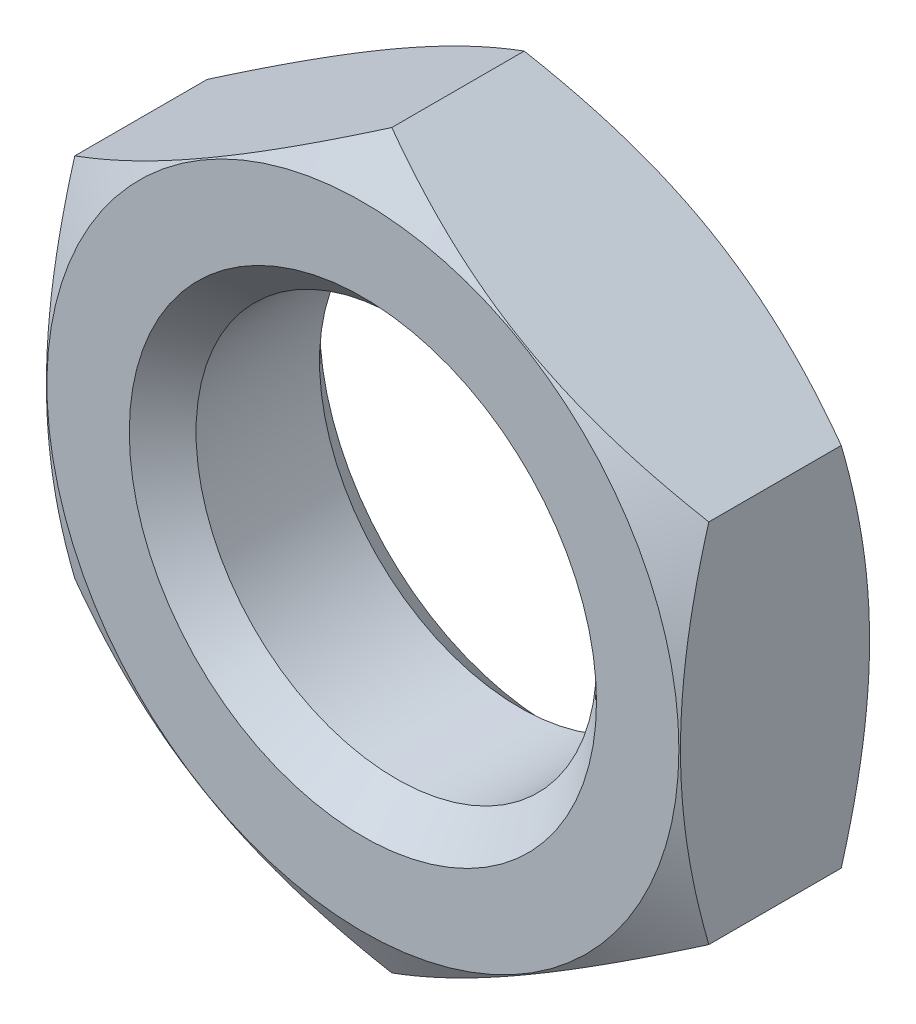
ISO-10303-21;
HEADER;
FILE_DESCRIPTION(('STEP AP214'),'2;1');
FILE_NAME('part.step','',(''),(''),'','','');
FILE_SCHEMA(('AUTOMOTIVE_DESIGN { 1 0 10303 214 1 1 1 1 }'));
ENDSEC;
DATA;
#1=APPLICATION_CONTEXT('core data for automotive mechanical design processes');
#2=APPLICATION_PROTOCOL_DEFINITION('international standard','automotive_design',2000,#1);
#3=PRODUCT_CONTEXT('',#1,'mechanical');
#4=PRODUCT('Part','Part','',(#3));
#5=PRODUCT_RELATED_PRODUCT_CATEGORY('part','',(#4));
#6=PRODUCT_DEFINITION_FORMATION('','',#4);
#7=PRODUCT_DEFINITION_CONTEXT('part definition',#1,'design');
#8=PRODUCT_DEFINITION('design','',#6,#7);
#9=PRODUCT_DEFINITION_SHAPE('','',#8);
#10=(LENGTH_UNIT() NAMED_UNIT(*) SI_UNIT(.MILLI.,.METRE.));
#11=(NAMED_UNIT(*) PLANE_ANGLE_UNIT() SI_UNIT($,.RADIAN.));
#12=(NAMED_UNIT(*) SI_UNIT($,.STERADIAN.) SOLID_ANGLE_UNIT());
#13=UNCERTAINTY_MEASURE_WITH_UNIT(LENGTH_MEASURE(1.E-05),#10,'distance_accuracy_value','');
#14=(GEOMETRIC_REPRESENTATION_CONTEXT(3) GLOBAL_UNCERTAINTY_ASSIGNED_CONTEXT((#13)) GLOBAL_UNIT_ASSIGNED_CONTEXT((#10,
#11,#12)) REPRESENTATION_CONTEXT('',''));
#15=CARTESIAN_POINT('',(0.,0.,0.));
#16=DIRECTION('',(0.,0.,1.));
#17=DIRECTION('',(1.,0.,0.));
#18=AXIS2_PLACEMENT_3D('',#15,#16,#17);
#19=CARTESIAN_POINT('',(9.5,5.48482755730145,2.85));
#20=DIRECTION('',(-0.5,-0.866025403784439,0.));
#21=DIRECTION('',(0.866025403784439,-0.5,0.));
#22=AXIS2_PLACEMENT_3D('',#19,#20,#21);
#23=PLANE('',#22);
#24=CARTESIAN_POINT('',(-0.000199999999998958,10.9697705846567,-1.98390792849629));
#25=CARTESIAN_POINT('',(0.208630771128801,10.8492020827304,-2.05350693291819));
#26=CARTESIAN_POINT('',(0.41824017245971,10.7281840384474,-2.11994706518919));
#27=CARTESIAN_POINT('',(0.839139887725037,10.4851774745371,-2.24563309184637));
#28=CARTESIAN_POINT('',(1.05043073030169,10.3631886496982,-2.30487662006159));
#29=CARTESIAN_POINT('',(1.68770779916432,9.99525656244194,-2.47066579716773));
#30=CARTESIAN_POINT('',(2.11620976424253,9.74786083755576,-2.56496593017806));
#31=CARTESIAN_POINT('',(2.75744333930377,9.37764446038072,-2.6755416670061));
#32=CARTESIAN_POINT('',(2.96825921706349,9.2559298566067,-2.70704054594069));
#33=CARTESIAN_POINT('',(3.39086703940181,9.01193711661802,-2.75986217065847));
#34=CARTESIAN_POINT('',(3.60265900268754,8.88965896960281,-2.78118472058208));
#35=CARTESIAN_POINT('',(4.02659621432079,8.64489870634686,-2.81310735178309));
#36=CARTESIAN_POINT('',(4.23874074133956,8.52241700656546,-2.82372017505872));
#37=CARTESIAN_POINT('',(4.66322575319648,8.27734047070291,-2.83399784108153));
#38=CARTESIAN_POINT('',(4.87556623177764,8.15474563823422,-2.83366302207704));
#39=CARTESIAN_POINT('',(5.27254199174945,7.92555157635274,-2.82280700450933));
#40=CARTESIAN_POINT('',(5.45720529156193,7.81893617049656,-2.81361010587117));
#41=CARTESIAN_POINT('',(5.82610000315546,7.60595470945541,-2.78711497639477));
#42=CARTESIAN_POINT('',(6.01033138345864,7.49958867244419,-2.76981617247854));
#43=CARTESIAN_POINT('',(6.562311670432,7.18090270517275,-2.70617589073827));
#44=CARTESIAN_POINT('',(6.92908353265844,6.96914687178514,-2.64809847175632));
#45=CARTESIAN_POINT('',(7.66651782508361,6.5433889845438,-2.50290435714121));
#46=CARTESIAN_POINT('',(8.03708614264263,6.32944126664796,-2.41517220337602));
#47=CARTESIAN_POINT('',(8.77269671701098,5.90473630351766,-2.21605663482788));
#48=CARTESIAN_POINT('',(9.13774839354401,5.69397361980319,-2.1047199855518));
#49=CARTESIAN_POINT('',(9.5002,5.48471208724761,-1.98390792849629));
#50=B_SPLINE_CURVE_WITH_KNOTS('',3,(#24,#25,#26,#27,#28,#29,#30,#31,#32,#33,#34,#35,#36,#37,#38,
#39,#40,#41,#42,#43,#44,#45,#46,#47,#48,#49),.UNSPECIFIED.,.F.,.F.,(4,2,2,2,2,2,2,2,2,2,2,2,4),
(0.,0.752880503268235,1.50600787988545,3.0154687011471,3.75167336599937,4.48789219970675,
5.22323407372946,5.95855322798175,6.5986808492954,7.23885375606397,8.52010929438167,
9.82978009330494,11.1368800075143),.UNSPECIFIED.);
#51=CARTESIAN_POINT('',(0.,10.9696551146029,-1.98397459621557));
#52=VERTEX_POINT('',#51);
#53=CARTESIAN_POINT('',(9.5,5.48482755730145,-1.98397459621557));
#54=VERTEX_POINT('',#53);
#55=EDGE_CURVE('E47',#52,#54,#50,.T.);
#56=ORIENTED_EDGE('',*,*,#55,.F.);
#57=DIRECTION('',(0.,0.,-1.));
#58=VECTOR('',#57,1.);
#59=CARTESIAN_POINT('',(0.,10.9696551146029,2.85));
#60=LINE('',#59,#58);
#61=CARTESIAN_POINT('',(0.,10.9696551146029,1.98397459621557));
#62=VERTEX_POINT('',#61);
#63=EDGE_CURVE('E96',#62,#52,#60,.T.);
#64=ORIENTED_EDGE('',*,*,#63,.F.);
#65=CARTESIAN_POINT('',(9.5002,5.48471208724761,1.98390792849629));
#66=CARTESIAN_POINT('',(9.2913692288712,5.6052805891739,2.05350693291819));
#67=CARTESIAN_POINT('',(9.08175982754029,5.72629863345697,2.11994706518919));
#68=CARTESIAN_POINT('',(8.66086011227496,5.96930519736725,2.24563309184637));
#69=CARTESIAN_POINT('',(8.44956926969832,6.09129402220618,2.30487662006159));
#70=CARTESIAN_POINT('',(7.81229220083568,6.4592261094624,2.47066579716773));
#71=CARTESIAN_POINT('',(7.38379023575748,6.70662183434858,2.56496593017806));
#72=CARTESIAN_POINT('',(6.74255666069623,7.07683821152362,2.6755416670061));
#73=CARTESIAN_POINT('',(6.53174078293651,7.19855281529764,2.70704054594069));
#74=CARTESIAN_POINT('',(6.10913296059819,7.44254555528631,2.75986217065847));
#75=CARTESIAN_POINT('',(5.89734099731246,7.56482370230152,2.78118472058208));
#76=CARTESIAN_POINT('',(5.47340378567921,7.80958396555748,2.81310735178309));
#77=CARTESIAN_POINT('',(5.26125925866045,7.93206566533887,2.82372017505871));
#78=CARTESIAN_POINT('',(4.83677424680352,8.17714220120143,2.83399784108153));
#79=CARTESIAN_POINT('',(4.62443376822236,8.29973703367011,2.83366302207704));
#80=CARTESIAN_POINT('',(4.22745800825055,8.5289310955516,2.82280700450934));
#81=CARTESIAN_POINT('',(4.04279470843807,8.63554650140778,2.81361010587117));
#82=CARTESIAN_POINT('',(3.67389999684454,8.84852796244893,2.78711497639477));
#83=CARTESIAN_POINT('',(3.48966861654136,8.95489399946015,2.76981617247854));
#84=CARTESIAN_POINT('',(2.937688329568,9.27357996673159,2.70617589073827));
#85=CARTESIAN_POINT('',(2.57091646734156,9.4853358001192,2.64809847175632));
#86=CARTESIAN_POINT('',(1.83348217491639,9.91109368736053,2.50290435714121));
#87=CARTESIAN_POINT('',(1.46291385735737,10.1250414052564,2.41517220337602));
#88=CARTESIAN_POINT('',(0.727303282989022,10.5497463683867,2.21605663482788));
#89=CARTESIAN_POINT('',(0.362251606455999,10.7605090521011,2.1047199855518));
#90=CARTESIAN_POINT('',(-0.000199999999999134,10.9697705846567,1.98390792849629));
#91=B_SPLINE_CURVE_WITH_KNOTS('',3,(#65,#66,#67,#68,#69,#70,#71,#72,#73,#74,#75,#76,#77,#78,#79,
#80,#81,#82,#83,#84,#85,#86,#87,#88,#89,#90),.UNSPECIFIED.,.F.,.F.,(4,2,2,2,2,2,2,2,2,2,2,2,4),
(0.,0.752880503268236,1.50600787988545,3.0154687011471,3.75167336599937,4.48789219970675,
5.22323407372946,5.95855322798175,6.5986808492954,7.23885375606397,8.52010929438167,
9.82978009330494,11.1368800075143),.UNSPECIFIED.);
#92=CARTESIAN_POINT('',(9.5,5.48482755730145,1.98397459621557));
#93=VERTEX_POINT('',#92);
#94=EDGE_CURVE('E198',#93,#62,#91,.T.);
#95=ORIENTED_EDGE('',*,*,#94,.F.);
#96=DIRECTION('',(0.,0.,-1.));
#97=VECTOR('',#96,1.);
#98=CARTESIAN_POINT('',(9.5,5.48482755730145,2.85));
#99=LINE('',#98,#97);
#100=EDGE_CURVE('E98',#93,#54,#99,.T.);
#101=ORIENTED_EDGE('',*,*,#100,.T.);
#102=EDGE_LOOP('',(#56,#64,#95,#101));
#103=FACE_BOUND('',#102,.T.);
#104=ADVANCED_FACE('F32',(#103),#23,.F.);
#105=CARTESIAN_POINT('',(0.,10.9696551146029,2.85));
#106=DIRECTION('',(0.5,-0.866025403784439,0.));
#107=DIRECTION('',(0.866025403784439,0.5,0.));
#108=AXIS2_PLACEMENT_3D('',#105,#106,#107);
#109=PLANE('',#108);
#110=CARTESIAN_POINT('',(-9.5002,5.48471208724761,-1.98390792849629));
#111=CARTESIAN_POINT('',(-9.2913692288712,5.6052805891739,-2.05350693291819));
#112=CARTESIAN_POINT('',(-9.08175982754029,5.72629863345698,-2.11994706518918));
#113=CARTESIAN_POINT('',(-8.66086011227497,5.96930519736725,-2.24563309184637));
#114=CARTESIAN_POINT('',(-8.44956926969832,6.09129402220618,-2.30487662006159));
#115=CARTESIAN_POINT('',(-7.81229220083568,6.4592261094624,-2.47066579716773));
#116=CARTESIAN_POINT('',(-7.38379023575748,6.70662183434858,-2.56496593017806));
#117=CARTESIAN_POINT('',(-6.74255666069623,7.07683821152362,-2.6755416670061));
#118=CARTESIAN_POINT('',(-6.53174078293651,7.19855281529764,-2.70704054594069));
#119=CARTESIAN_POINT('',(-6.10913296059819,7.44254555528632,-2.75986217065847));
#120=CARTESIAN_POINT('',(-5.89734099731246,7.56482370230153,-2.78118472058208));
#121=CARTESIAN_POINT('',(-5.47340378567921,7.80958396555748,-2.81310735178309));
#122=CARTESIAN_POINT('',(-5.26125925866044,7.93206566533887,-2.82372017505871));
#123=CARTESIAN_POINT('',(-4.83677424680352,8.17714220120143,-2.83399784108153));
#124=CARTESIAN_POINT('',(-4.62443376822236,8.29973703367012,-2.83366302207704));
#125=CARTESIAN_POINT('',(-4.22745800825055,8.5289310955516,-2.82280700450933));
#126=CARTESIAN_POINT('',(-4.04279470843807,8.63554650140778,-2.81361010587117));
#127=CARTESIAN_POINT('',(-3.67389999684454,8.84852796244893,-2.78711497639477));
#128=CARTESIAN_POINT('',(-3.48966861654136,8.95489399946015,-2.76981617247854));
#129=CARTESIAN_POINT('',(-2.937688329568,9.27357996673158,-2.70617589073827));
#130=CARTESIAN_POINT('',(-2.57091646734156,9.4853358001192,-2.64809847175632));
#131=CARTESIAN_POINT('',(-1.83348217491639,9.91109368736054,-2.50290435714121));
#132=CARTESIAN_POINT('',(-1.46291385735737,10.1250414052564,-2.41517220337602));
#133=CARTESIAN_POINT('',(-0.72730328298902,10.5497463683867,-2.21605663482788));
#134=CARTESIAN_POINT('',(-0.362251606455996,10.7605090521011,-2.1047199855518));
#135=CARTESIAN_POINT('',(0.000200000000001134,10.9697705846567,-1.98390792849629));
#136=B_SPLINE_CURVE_WITH_KNOTS('',3,(#110,#111,#112,#113,#114,#115,#116,#117,#118,#119,#120,
#121,#122,#123,#124,#125,#126,#127,#128,#129,#130,#131,#132,#133,#134,#135),.UNSPECIFIED.,.F.,
.F.,(4,2,2,2,2,2,2,2,2,2,2,2,4),(0.,0.752880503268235,1.50600787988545,3.0154687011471,
3.75167336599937,4.48789219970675,5.22323407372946,5.95855322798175,6.59868084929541,
7.23885375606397,8.52010929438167,9.82978009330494,11.1368800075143),.UNSPECIFIED.);
#137=CARTESIAN_POINT('',(-9.5,5.48482755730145,-1.98397459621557));
#138=VERTEX_POINT('',#137);
#139=EDGE_CURVE('E83',#138,#52,#136,.T.);
#140=ORIENTED_EDGE('',*,*,#139,.F.);
#141=DIRECTION('',(0.,0.,-1.));
#142=VECTOR('',#141,1.);
#143=CARTESIAN_POINT('',(-9.5,5.48482755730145,2.85));
#144=LINE('',#143,#142);
#145=CARTESIAN_POINT('',(-9.5,5.48482755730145,1.98397459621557));
#146=VERTEX_POINT('',#145);
#147=EDGE_CURVE('E105',#146,#138,#144,.T.);
#148=ORIENTED_EDGE('',*,*,#147,.F.);
#149=CARTESIAN_POINT('',(0.000200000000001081,10.9697705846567,1.98390792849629));
#150=CARTESIAN_POINT('',(-0.208630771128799,10.8492020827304,2.05350693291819));
#151=CARTESIAN_POINT('',(-0.418240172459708,10.7281840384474,2.11994706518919));
#152=CARTESIAN_POINT('',(-0.839139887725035,10.4851774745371,2.24563309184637));
#153=CARTESIAN_POINT('',(-1.05043073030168,10.3631886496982,2.30487662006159));
#154=CARTESIAN_POINT('',(-1.68770779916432,9.99525656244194,2.47066579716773));
#155=CARTESIAN_POINT('',(-2.11620976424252,9.74786083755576,2.56496593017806));
#156=CARTESIAN_POINT('',(-2.75744333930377,9.37764446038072,2.6755416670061));
#157=CARTESIAN_POINT('',(-2.96825921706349,9.2559298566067,2.70704054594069));
#158=CARTESIAN_POINT('',(-3.39086703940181,9.01193711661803,2.75986217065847));
#159=CARTESIAN_POINT('',(-3.60265900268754,8.88965896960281,2.78118472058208));
#160=CARTESIAN_POINT('',(-4.02659621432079,8.64489870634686,2.81310735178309));
#161=CARTESIAN_POINT('',(-4.23874074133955,8.52241700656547,2.82372017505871));
#162=CARTESIAN_POINT('',(-4.66322575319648,8.27734047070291,2.83399784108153));
#163=CARTESIAN_POINT('',(-4.87556623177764,8.15474563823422,2.83366302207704));
#164=CARTESIAN_POINT('',(-5.27254199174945,7.92555157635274,2.82280700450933));
#165=CARTESIAN_POINT('',(-5.45720529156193,7.81893617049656,2.81361010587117));
#166=CARTESIAN_POINT('',(-5.82610000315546,7.60595470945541,2.78711497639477));
#167=CARTESIAN_POINT('',(-6.01033138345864,7.49958867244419,2.76981617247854));
#168=CARTESIAN_POINT('',(-6.562311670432,7.18090270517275,2.70617589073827));
#169=CARTESIAN_POINT('',(-6.92908353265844,6.96914687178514,2.64809847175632));
#170=CARTESIAN_POINT('',(-7.66651782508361,6.5433889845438,2.50290435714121));
#171=CARTESIAN_POINT('',(-8.03708614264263,6.32944126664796,2.41517220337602));
#172=CARTESIAN_POINT('',(-8.77269671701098,5.90473630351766,2.21605663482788));
#173=CARTESIAN_POINT('',(-9.137748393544,5.69397361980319,2.1047199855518));
#174=CARTESIAN_POINT('',(-9.5002,5.48471208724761,1.98390792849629));
#175=B_SPLINE_CURVE_WITH_KNOTS('',3,(#149,#150,#151,#152,#153,#154,#155,#156,#157,#158,#159,
#160,#161,#162,#163,#164,#165,#166,#167,#168,#169,#170,#171,#172,#173,#174),.UNSPECIFIED.,.F.,
.F.,(4,2,2,2,2,2,2,2,2,2,2,2,4),(0.,0.752880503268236,1.50600787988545,3.0154687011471,
3.75167336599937,4.48789219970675,5.22323407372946,5.95855322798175,6.59868084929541,
7.23885375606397,8.52010929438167,9.82978009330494,11.1368800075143),.UNSPECIFIED.);
#176=EDGE_CURVE('E103',#62,#146,#175,.T.);
#177=ORIENTED_EDGE('',*,*,#176,.F.);
#178=ORIENTED_EDGE('',*,*,#63,.T.);
#179=EDGE_LOOP('',(#140,#148,#177,#178));
#180=FACE_BOUND('',#179,.T.);
#181=ADVANCED_FACE('F102',(#180),#109,.F.);
#182=CARTESIAN_POINT('',(-9.5,5.48482755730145,2.85));
#183=DIRECTION('',(1.,0.,0.));
#184=DIRECTION('',(0.,0.,-1.));
#185=AXIS2_PLACEMENT_3D('',#182,#183,#184);
#186=PLANE('',#185);
#187=CARTESIAN_POINT('',(-9.5,-14.5441411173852,1.71234877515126));
#188=CARTESIAN_POINT('',(-9.5,-14.3356064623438,1.6115512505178));
#189=CARTESIAN_POINT('',(-9.5,-14.1268196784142,1.51127559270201));
#190=CARTESIAN_POINT('',(-9.5,-13.7086885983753,1.31188780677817));
#191=CARTESIAN_POINT('',(-9.5,-13.499344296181,1.2127756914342));
#192=CARTESIAN_POINT('',(-9.5,-12.8703338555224,0.917335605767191));
#193=CARTESIAN_POINT('',(-9.5,-12.4497580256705,0.722936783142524));
#194=CARTESIAN_POINT('',(-9.5,-11.6032912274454,0.339426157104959));
#195=CARTESIAN_POINT('',(-9.5,-11.1773836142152,0.150350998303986));
#196=CARTESIAN_POINT('',(-9.5,-10.3220676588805,-0.21967779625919));
#197=CARTESIAN_POINT('',(-9.5,-9.89265950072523,-0.400631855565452));
#198=CARTESIAN_POINT('',(-9.5,-9.02433880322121,-0.754397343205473));
#199=CARTESIAN_POINT('',(-9.5,-8.58537427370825,-0.927081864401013));
#200=CARTESIAN_POINT('',(-9.5,-7.7022679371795,-1.25892058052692));
#201=CARTESIAN_POINT('',(-9.5,-7.25812556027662,-1.41807326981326));
#202=CARTESIAN_POINT('',(-9.5,-6.36486440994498,-1.71856922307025));
#203=CARTESIAN_POINT('',(-9.5,-5.91575852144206,-1.85995037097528));
#204=CARTESIAN_POINT('',(-9.5,-5.01117837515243,-2.12031248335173));
#205=CARTESIAN_POINT('',(-9.5,-4.55570618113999,-2.23930053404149));
#206=CARTESIAN_POINT('',(-9.5,-3.63800520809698,-2.44908988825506));
#207=CARTESIAN_POINT('',(-9.5,-3.17577463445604,-2.53988355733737));
#208=CARTESIAN_POINT('',(-9.5,-2.47836338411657,-2.65038075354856));
#209=CARTESIAN_POINT('',(-9.5,-2.24518677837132,-2.68293333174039));
#210=CARTESIAN_POINT('',(-9.5,-1.77774118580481,-2.73883350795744));
#211=CARTESIAN_POINT('',(-9.5,-1.54347230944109,-2.76218201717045));
#212=CARTESIAN_POINT('',(-9.5,-1.07564354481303,-2.79904583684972));
#213=CARTESIAN_POINT('',(-9.5,-0.842088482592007,-2.81262214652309));
#214=CARTESIAN_POINT('',(-9.5,-0.374613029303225,-2.82986982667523));
#215=CARTESIAN_POINT('',(-9.5,-0.140692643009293,-2.83354132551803));
#216=CARTESIAN_POINT('',(-9.5,0.327026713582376,-2.83089191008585));
#217=CARTESIAN_POINT('',(-9.5,0.560825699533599,-2.8245737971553));
#218=CARTESIAN_POINT('',(-9.5,1.02795364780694,-2.80210220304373));
#219=CARTESIAN_POINT('',(-9.5,1.26128258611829,-2.78594823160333));
#220=CARTESIAN_POINT('',(-9.5,1.82687816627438,-2.735206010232));
#221=CARTESIAN_POINT('',(-9.5,2.15870953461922,-2.69568528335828));
#222=CARTESIAN_POINT('',(-9.5,2.81982783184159,-2.59894476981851));
#223=CARTESIAN_POINT('',(-9.5,3.14911404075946,-2.54172015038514));
#224=CARTESIAN_POINT('',(-9.5,3.80487091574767,-2.41160145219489));
#225=CARTESIAN_POINT('',(-9.5,4.1313386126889,-2.33869255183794));
#226=CARTESIAN_POINT('',(-9.5,4.78091434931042,-2.17942968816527));
#227=CARTESIAN_POINT('',(-9.5,5.10402270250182,-2.0930769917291));
#228=CARTESIAN_POINT('',(-9.5,5.75483447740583,-1.90673599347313));
#229=CARTESIAN_POINT('',(-9.5,6.08245652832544,-1.80646544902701));
#230=CARTESIAN_POINT('',(-9.5,6.73423760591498,-1.59602223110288));
#231=CARTESIAN_POINT('',(-9.5,7.05839885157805,-1.48585638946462));
#232=CARTESIAN_POINT('',(-9.5,7.70195753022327,-1.25789772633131));
#233=CARTESIAN_POINT('',(-9.5,8.02137150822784,-1.14015133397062));
#234=CARTESIAN_POINT('',(-9.5,8.65772169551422,-0.897750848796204));
#235=CARTESIAN_POINT('',(-9.5,8.97465684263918,-0.773093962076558));
#236=CARTESIAN_POINT('',(-9.5,9.29044082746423,-0.645665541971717));
#237=B_SPLINE_CURVE_WITH_KNOTS('',3,(#187,#188,#189,#190,#191,#192,#193,#194,#195,#196,#197,
#198,#199,#200,#201,#202,#203,#204,#205,#206,#207,#208,#209,#210,#211,#212,#213,#214,#215,#216,
#217,#218,#219,#220,#221,#222,#223,#224,#225,#226,#227,#228,#229,#230,#231,#232,#233,#234,#235,
#236),.UNSPECIFIED.,.F.,.F.,(4,2,2,2,2,2,2,2,2,2,2,2,2,2,2,2,2,2,2,2,2,2,2,2,4),(0.,
0.694852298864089,1.38971221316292,2.77965820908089,4.17756254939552,5.57539389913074,
6.99034929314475,8.40546191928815,9.81750483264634,11.2291001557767,12.6410773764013,
13.3472378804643,14.0533284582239,14.754972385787,15.4566072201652,16.1580453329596,
16.859518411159,17.8614895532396,18.8637344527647,19.866930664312,20.8700323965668,
21.897710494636,22.9246844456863,23.9458768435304,24.9674851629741),.UNSPECIFIED.);
#238=CARTESIAN_POINT('',(-9.5,-5.48482755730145,-1.98397459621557));
#239=VERTEX_POINT('',#238);
#240=EDGE_CURVE('E86',#239,#138,#237,.T.);
#241=ORIENTED_EDGE('',*,*,#240,.F.);
#242=DIRECTION('',(0.,0.,-1.));
#243=VECTOR('',#242,1.);
#244=CARTESIAN_POINT('',(-9.5,-5.48482755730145,2.85));
#245=LINE('',#244,#243);
#246=CARTESIAN_POINT('',(-9.5,-5.48482755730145,1.98397459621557));
#247=VERTEX_POINT('',#246);
#248=EDGE_CURVE('E110',#247,#239,#245,.T.);
#249=ORIENTED_EDGE('',*,*,#248,.F.);
#250=CARTESIAN_POINT('',(-9.5,-14.5441411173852,-1.71234877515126));
#251=CARTESIAN_POINT('',(-9.5,-14.3356064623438,-1.6115512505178));
#252=CARTESIAN_POINT('',(-9.5,-14.1268196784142,-1.51127559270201));
#253=CARTESIAN_POINT('',(-9.5,-13.7086885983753,-1.31188780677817));
#254=CARTESIAN_POINT('',(-9.5,-13.499344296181,-1.2127756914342));
#255=CARTESIAN_POINT('',(-9.5,-12.8703338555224,-0.917335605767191));
#256=CARTESIAN_POINT('',(-9.5,-12.4497580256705,-0.722936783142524));
#257=CARTESIAN_POINT('',(-9.5,-11.6032912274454,-0.339426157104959));
#258=CARTESIAN_POINT('',(-9.5,-11.1773836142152,-0.150350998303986));
#259=CARTESIAN_POINT('',(-9.5,-10.3220676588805,0.21967779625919));
#260=CARTESIAN_POINT('',(-9.5,-9.89265950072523,0.400631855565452));
#261=CARTESIAN_POINT('',(-9.5,-9.02433880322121,0.754397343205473));
#262=CARTESIAN_POINT('',(-9.5,-8.58537427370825,0.927081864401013));
#263=CARTESIAN_POINT('',(-9.5,-7.7022679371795,1.25892058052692));
#264=CARTESIAN_POINT('',(-9.5,-7.25812556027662,1.41807326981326));
#265=CARTESIAN_POINT('',(-9.5,-6.36486440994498,1.71856922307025));
#266=CARTESIAN_POINT('',(-9.5,-5.91575852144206,1.85995037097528));
#267=CARTESIAN_POINT('',(-9.5,-5.01117837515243,2.12031248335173));
#268=CARTESIAN_POINT('',(-9.5,-4.55570618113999,2.23930053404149));
#269=CARTESIAN_POINT('',(-9.5,-3.63800520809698,2.44908988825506));
#270=CARTESIAN_POINT('',(-9.5,-3.17577463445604,2.53988355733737));
#271=CARTESIAN_POINT('',(-9.5,-2.47836338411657,2.65038075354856));
#272=CARTESIAN_POINT('',(-9.5,-2.24518677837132,2.68293333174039));
#273=CARTESIAN_POINT('',(-9.5,-1.77774118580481,2.73883350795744));
#274=CARTESIAN_POINT('',(-9.5,-1.54347230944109,2.76218201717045));
#275=CARTESIAN_POINT('',(-9.5,-1.07564354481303,2.79904583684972));
#276=CARTESIAN_POINT('',(-9.5,-0.842088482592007,2.81262214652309));
#277=CARTESIAN_POINT('',(-9.5,-0.374613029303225,2.82986982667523));
#278=CARTESIAN_POINT('',(-9.5,-0.140692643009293,2.83354132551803));
#279=CARTESIAN_POINT('',(-9.5,0.327026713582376,2.83089191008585));
#280=CARTESIAN_POINT('',(-9.5,0.560825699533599,2.8245737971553));
#281=CARTESIAN_POINT('',(-9.5,1.02795364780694,2.80210220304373));
#282=CARTESIAN_POINT('',(-9.5,1.26128258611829,2.78594823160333));
#283=CARTESIAN_POINT('',(-9.5,1.82687816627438,2.735206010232));
#284=CARTESIAN_POINT('',(-9.5,2.15870953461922,2.69568528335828));
#285=CARTESIAN_POINT('',(-9.5,2.81982783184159,2.59894476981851));
#286=CARTESIAN_POINT('',(-9.5,3.14911404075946,2.54172015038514));
#287=CARTESIAN_POINT('',(-9.5,3.80487091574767,2.41160145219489));
#288=CARTESIAN_POINT('',(-9.5,4.1313386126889,2.33869255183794));
#289=CARTESIAN_POINT('',(-9.5,4.78091434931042,2.17942968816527));
#290=CARTESIAN_POINT('',(-9.5,5.10402270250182,2.0930769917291));
#291=CARTESIAN_POINT('',(-9.5,5.75483447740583,1.90673599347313));
#292=CARTESIAN_POINT('',(-9.5,6.08245652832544,1.80646544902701));
#293=CARTESIAN_POINT('',(-9.5,6.73423760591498,1.59602223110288));
#294=CARTESIAN_POINT('',(-9.5,7.05839885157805,1.48585638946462));
#295=CARTESIAN_POINT('',(-9.5,7.70195753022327,1.25789772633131));
#296=CARTESIAN_POINT('',(-9.5,8.02137150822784,1.14015133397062));
#297=CARTESIAN_POINT('',(-9.5,8.65772169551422,0.897750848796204));
#298=CARTESIAN_POINT('',(-9.5,8.97465684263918,0.773093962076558));
#299=CARTESIAN_POINT('',(-9.5,9.29044082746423,0.645665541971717));
#300=B_SPLINE_CURVE_WITH_KNOTS('',3,(#250,#251,#252,#253,#254,#255,#256,#257,#258,#259,#260,
#261,#262,#263,#264,#265,#266,#267,#268,#269,#270,#271,#272,#273,#274,#275,#276,#277,#278,#279,
#280,#281,#282,#283,#284,#285,#286,#287,#288,#289,#290,#291,#292,#293,#294,#295,#296,#297,#298,
#299),.UNSPECIFIED.,.F.,.F.,(4,2,2,2,2,2,2,2,2,2,2,2,2,2,2,2,2,2,2,2,2,2,2,2,4),(0.,
0.694852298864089,1.38971221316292,2.77965820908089,4.17756254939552,5.57539389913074,
6.99034929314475,8.40546191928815,9.81750483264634,11.2291001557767,12.6410773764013,
13.3472378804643,14.0533284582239,14.754972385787,15.4566072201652,16.1580453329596,
16.859518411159,17.8614895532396,18.8637344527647,19.866930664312,20.8700323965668,
21.897710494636,22.9246844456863,23.9458768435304,24.9674851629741),.UNSPECIFIED.);
#301=EDGE_CURVE('E188',#146,#247,#300,.F.);
#302=ORIENTED_EDGE('',*,*,#301,.F.);
#303=ORIENTED_EDGE('',*,*,#147,.T.);
#304=EDGE_LOOP('',(#241,#249,#302,#303));
#305=FACE_BOUND('',#304,.T.);
#306=ADVANCED_FACE('F206',(#305),#186,.F.);
#307=CARTESIAN_POINT('',(-9.5,-5.48482755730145,2.85));
#308=DIRECTION('',(0.5,0.866025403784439,0.));
#309=DIRECTION('',(-0.866025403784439,0.5,0.));
#310=AXIS2_PLACEMENT_3D('',#307,#308,#309);
#311=PLANE('',#310);
#312=CARTESIAN_POINT('',(0.000199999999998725,-10.9697705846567,-1.98390792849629));
#313=CARTESIAN_POINT('',(-0.208630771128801,-10.8492020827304,-2.05350693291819));
#314=CARTESIAN_POINT('',(-0.41824017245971,-10.7281840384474,-2.11994706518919));
#315=CARTESIAN_POINT('',(-0.839139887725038,-10.4851774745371,-2.24563309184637));
#316=CARTESIAN_POINT('',(-1.05043073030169,-10.3631886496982,-2.30487662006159));
#317=CARTESIAN_POINT('',(-1.68770779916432,-9.99525656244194,-2.47066579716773));
#318=CARTESIAN_POINT('',(-2.11620976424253,-9.74786083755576,-2.56496593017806));
#319=CARTESIAN_POINT('',(-2.75744333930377,-9.37764446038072,-2.6755416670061));
#320=CARTESIAN_POINT('',(-2.96825921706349,-9.2559298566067,-2.70704054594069));
#321=CARTESIAN_POINT('',(-3.39086703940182,-9.01193711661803,-2.75986217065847));
#322=CARTESIAN_POINT('',(-3.60265900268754,-8.88965896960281,-2.78118472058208));
#323=CARTESIAN_POINT('',(-4.02659621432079,-8.64489870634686,-2.81310735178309));
#324=CARTESIAN_POINT('',(-4.23874074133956,-8.52241700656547,-2.82372017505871));
#325=CARTESIAN_POINT('',(-4.66322575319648,-8.27734047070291,-2.83399784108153));
#326=CARTESIAN_POINT('',(-4.87556623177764,-8.15474563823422,-2.83366302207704));
#327=CARTESIAN_POINT('',(-5.27254199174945,-7.92555157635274,-2.82280700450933));
#328=CARTESIAN_POINT('',(-5.45720529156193,-7.81893617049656,-2.81361010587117));
#329=CARTESIAN_POINT('',(-5.82610000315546,-7.60595470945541,-2.78711497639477));
#330=CARTESIAN_POINT('',(-6.01033138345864,-7.49958867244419,-2.76981617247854));
#331=CARTESIAN_POINT('',(-6.562311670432,-7.18090270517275,-2.70617589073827));
#332=CARTESIAN_POINT('',(-6.92908353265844,-6.96914687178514,-2.64809847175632));
#333=CARTESIAN_POINT('',(-7.66651782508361,-6.5433889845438,-2.50290435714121));
#334=CARTESIAN_POINT('',(-8.03708614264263,-6.32944126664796,-2.41517220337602));
#335=CARTESIAN_POINT('',(-8.77269671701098,-5.90473630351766,-2.21605663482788));
#336=CARTESIAN_POINT('',(-9.13774839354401,-5.69397361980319,-2.1047199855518));
#337=CARTESIAN_POINT('',(-9.5002,-5.48471208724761,-1.98390792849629));
#338=B_SPLINE_CURVE_WITH_KNOTS('',3,(#312,#313,#314,#315,#316,#317,#318,#319,#320,#321,#322,
#323,#324,#325,#326,#327,#328,#329,#330,#331,#332,#333,#334,#335,#336,#337),.UNSPECIFIED.,.F.,
.F.,(4,2,2,2,2,2,2,2,2,2,2,2,4),(0.,0.752880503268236,1.50600787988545,3.0154687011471,
3.75167336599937,4.48789219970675,5.22323407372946,5.95855322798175,6.59868084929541,
7.23885375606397,8.52010929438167,9.82978009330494,11.1368800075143),.UNSPECIFIED.);
#339=CARTESIAN_POINT('',(0.,-10.9696551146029,-1.98397459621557));
#340=VERTEX_POINT('',#339);
#341=EDGE_CURVE('E220',#340,#239,#338,.T.);
#342=ORIENTED_EDGE('',*,*,#341,.F.);
#343=DIRECTION('',(0.,0.,-1.));
#344=VECTOR('',#343,1.);
#345=CARTESIAN_POINT('',(0.,-10.9696551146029,2.85));
#346=LINE('',#345,#344);
#347=CARTESIAN_POINT('',(0.,-10.9696551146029,1.98397459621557));
#348=VERTEX_POINT('',#347);
#349=EDGE_CURVE('E320',#348,#340,#346,.T.);
#350=ORIENTED_EDGE('',*,*,#349,.F.);
#351=CARTESIAN_POINT('',(-9.5002,-5.48471208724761,1.98390792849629));
#352=CARTESIAN_POINT('',(-9.2913692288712,-5.6052805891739,2.05350693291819));
#353=CARTESIAN_POINT('',(-9.08175982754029,-5.72629863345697,2.11994706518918));
#354=CARTESIAN_POINT('',(-8.66086011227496,-5.96930519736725,2.24563309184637));
#355=CARTESIAN_POINT('',(-8.44956926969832,-6.09129402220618,2.30487662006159));
#356=CARTESIAN_POINT('',(-7.81229220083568,-6.4592261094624,2.47066579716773));
#357=CARTESIAN_POINT('',(-7.38379023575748,-6.70662183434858,2.56496593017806));
#358=CARTESIAN_POINT('',(-6.74255666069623,-7.07683821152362,2.6755416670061));
#359=CARTESIAN_POINT('',(-6.53174078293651,-7.19855281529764,2.70704054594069));
#360=CARTESIAN_POINT('',(-6.10913296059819,-7.44254555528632,2.75986217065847));
#361=CARTESIAN_POINT('',(-5.89734099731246,-7.56482370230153,2.78118472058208));
#362=CARTESIAN_POINT('',(-5.47340378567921,-7.80958396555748,2.81310735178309));
#363=CARTESIAN_POINT('',(-5.26125925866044,-7.93206566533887,2.82372017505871));
#364=CARTESIAN_POINT('',(-4.83677424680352,-8.17714220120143,2.83399784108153));
#365=CARTESIAN_POINT('',(-4.62443376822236,-8.29973703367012,2.83366302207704));
#366=CARTESIAN_POINT('',(-4.22745800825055,-8.5289310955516,2.82280700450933));
#367=CARTESIAN_POINT('',(-4.04279470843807,-8.63554650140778,2.81361010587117));
#368=CARTESIAN_POINT('',(-3.67389999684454,-8.84852796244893,2.78711497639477));
#369=CARTESIAN_POINT('',(-3.48966861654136,-8.95489399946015,2.76981617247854));
#370=CARTESIAN_POINT('',(-2.937688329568,-9.27357996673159,2.70617589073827));
#371=CARTESIAN_POINT('',(-2.57091646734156,-9.4853358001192,2.64809847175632));
#372=CARTESIAN_POINT('',(-1.83348217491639,-9.91109368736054,2.50290435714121));
#373=CARTESIAN_POINT('',(-1.46291385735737,-10.1250414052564,2.41517220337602));
#374=CARTESIAN_POINT('',(-0.727303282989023,-10.5497463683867,2.21605663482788));
#375=CARTESIAN_POINT('',(-0.362251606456,-10.7605090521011,2.1047199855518));
#376=CARTESIAN_POINT('',(0.000199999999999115,-10.9697705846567,1.98390792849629));
#377=B_SPLINE_CURVE_WITH_KNOTS('',3,(#351,#352,#353,#354,#355,#356,#357,#358,#359,#360,#361,
#362,#363,#364,#365,#366,#367,#368,#369,#370,#371,#372,#373,#374,#375,#376),.UNSPECIFIED.,.F.,
.F.,(4,2,2,2,2,2,2,2,2,2,2,2,4),(0.,0.752880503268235,1.50600787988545,3.0154687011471,
3.75167336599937,4.48789219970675,5.22323407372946,5.95855322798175,6.59868084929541,
7.23885375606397,8.52010929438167,9.82978009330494,11.1368800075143),.UNSPECIFIED.);
#378=EDGE_CURVE('E183',#247,#348,#377,.T.);
#379=ORIENTED_EDGE('',*,*,#378,.F.);
#380=ORIENTED_EDGE('',*,*,#248,.T.);
#381=EDGE_LOOP('',(#342,#350,#379,#380));
#382=FACE_BOUND('',#381,.T.);
#383=ADVANCED_FACE('F224',(#382),#311,.F.);
#384=CARTESIAN_POINT('',(0.,-10.9696551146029,2.85));
#385=DIRECTION('',(-0.5,0.866025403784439,0.));
#386=DIRECTION('',(-0.866025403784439,-0.5,0.));
#387=AXIS2_PLACEMENT_3D('',#384,#385,#386);
#388=PLANE('',#387);
#389=CARTESIAN_POINT('',(9.5002,-5.48471208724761,-1.98390792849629));
#390=CARTESIAN_POINT('',(9.2913692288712,-5.6052805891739,-2.05350693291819));
#391=CARTESIAN_POINT('',(9.08175982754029,-5.72629863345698,-2.11994706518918));
#392=CARTESIAN_POINT('',(8.66086011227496,-5.96930519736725,-2.24563309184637));
#393=CARTESIAN_POINT('',(8.44956926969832,-6.09129402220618,-2.30487662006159));
#394=CARTESIAN_POINT('',(7.81229220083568,-6.4592261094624,-2.47066579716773));
#395=CARTESIAN_POINT('',(7.38379023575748,-6.70662183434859,-2.56496593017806));
#396=CARTESIAN_POINT('',(6.74255666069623,-7.07683821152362,-2.6755416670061));
#397=CARTESIAN_POINT('',(6.53174078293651,-7.19855281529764,-2.70704054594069));
#398=CARTESIAN_POINT('',(6.10913296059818,-7.44254555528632,-2.75986217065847));
#399=CARTESIAN_POINT('',(5.89734099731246,-7.56482370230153,-2.78118472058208));
#400=CARTESIAN_POINT('',(5.47340378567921,-7.80958396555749,-2.81310735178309));
#401=CARTESIAN_POINT('',(5.26125925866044,-7.93206566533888,-2.82372017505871));
#402=CARTESIAN_POINT('',(4.83677424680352,-8.17714220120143,-2.83399784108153));
#403=CARTESIAN_POINT('',(4.62443376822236,-8.29973703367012,-2.83366302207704));
#404=CARTESIAN_POINT('',(4.22745800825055,-8.5289310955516,-2.82280700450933));
#405=CARTESIAN_POINT('',(4.04279470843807,-8.63554650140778,-2.81361010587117));
#406=CARTESIAN_POINT('',(3.67389999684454,-8.84852796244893,-2.78711497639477));
#407=CARTESIAN_POINT('',(3.48966861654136,-8.95489399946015,-2.76981617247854));
#408=CARTESIAN_POINT('',(2.937688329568,-9.27357996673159,-2.70617589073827));
#409=CARTESIAN_POINT('',(2.57091646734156,-9.4853358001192,-2.64809847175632));
#410=CARTESIAN_POINT('',(1.83348217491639,-9.91109368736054,-2.5029043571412));
#411=CARTESIAN_POINT('',(1.46291385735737,-10.1250414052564,-2.41517220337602));
#412=CARTESIAN_POINT('',(0.727303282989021,-10.5497463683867,-2.21605663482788));
#413=CARTESIAN_POINT('',(0.362251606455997,-10.7605090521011,-2.1047199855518));
#414=CARTESIAN_POINT('',(-0.000200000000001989,-10.9697705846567,-1.98390792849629));
#415=B_SPLINE_CURVE_WITH_KNOTS('',3,(#389,#390,#391,#392,#393,#394,#395,#396,#397,#398,#399,
#400,#401,#402,#403,#404,#405,#406,#407,#408,#409,#410,#411,#412,#413,#414),.UNSPECIFIED.,.F.,
.F.,(4,2,2,2,2,2,2,2,2,2,2,2,4),(0.,0.752880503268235,1.50600787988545,3.0154687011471,
3.75167336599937,4.48789219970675,5.22323407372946,5.95855322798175,6.59868084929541,
7.23885375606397,8.52010929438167,9.82978009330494,11.1368800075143),.UNSPECIFIED.);
#416=CARTESIAN_POINT('',(9.5,-5.48482755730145,-1.98397459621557));
#417=VERTEX_POINT('',#416);
#418=EDGE_CURVE('E136',#417,#340,#415,.T.);
#419=ORIENTED_EDGE('',*,*,#418,.F.);
#420=DIRECTION('',(0.,0.,-1.));
#421=VECTOR('',#420,1.);
#422=CARTESIAN_POINT('',(9.5,-5.48482755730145,2.85));
#423=LINE('',#422,#421);
#424=CARTESIAN_POINT('',(9.5,-5.48482755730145,1.98397459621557));
#425=VERTEX_POINT('',#424);
#426=EDGE_CURVE('E318',#425,#417,#423,.T.);
#427=ORIENTED_EDGE('',*,*,#426,.F.);
#428=CARTESIAN_POINT('',(-0.000200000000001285,-10.9697705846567,1.98390792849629));
#429=CARTESIAN_POINT('',(0.208630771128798,-10.8492020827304,2.05350693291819));
#430=CARTESIAN_POINT('',(0.418240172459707,-10.7281840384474,2.11994706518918));
#431=CARTESIAN_POINT('',(0.839139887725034,-10.4851774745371,2.24563309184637));
#432=CARTESIAN_POINT('',(1.05043073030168,-10.3631886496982,2.30487662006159));
#433=CARTESIAN_POINT('',(1.68770779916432,-9.99525656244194,2.47066579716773));
#434=CARTESIAN_POINT('',(2.11620976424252,-9.74786083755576,2.56496593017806));
#435=CARTESIAN_POINT('',(2.75744333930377,-9.37764446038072,2.6755416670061));
#436=CARTESIAN_POINT('',(2.96825921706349,-9.2559298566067,2.70704054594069));
#437=CARTESIAN_POINT('',(3.39086703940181,-9.01193711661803,2.75986217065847));
#438=CARTESIAN_POINT('',(3.60265900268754,-8.88965896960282,2.78118472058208));
#439=CARTESIAN_POINT('',(4.02659621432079,-8.64489870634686,2.81310735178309));
#440=CARTESIAN_POINT('',(4.23874074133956,-8.52241700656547,2.82372017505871));
#441=CARTESIAN_POINT('',(4.66322575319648,-8.27734047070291,2.83399784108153));
#442=CARTESIAN_POINT('',(4.87556623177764,-8.15474563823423,2.83366302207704));
#443=CARTESIAN_POINT('',(5.27254199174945,-7.92555157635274,2.82280700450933));
#444=CARTESIAN_POINT('',(5.45720529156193,-7.81893617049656,2.81361010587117));
#445=CARTESIAN_POINT('',(5.82610000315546,-7.60595470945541,2.78711497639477));
#446=CARTESIAN_POINT('',(6.01033138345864,-7.49958867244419,2.76981617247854));
#447=CARTESIAN_POINT('',(6.562311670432,-7.18090270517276,2.70617589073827));
#448=CARTESIAN_POINT('',(6.92908353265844,-6.96914687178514,2.64809847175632));
#449=CARTESIAN_POINT('',(7.66651782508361,-6.54338898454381,2.5029043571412));
#450=CARTESIAN_POINT('',(8.03708614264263,-6.32944126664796,2.41517220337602));
#451=CARTESIAN_POINT('',(8.77269671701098,-5.90473630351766,2.21605663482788));
#452=CARTESIAN_POINT('',(9.137748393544,-5.6939736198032,2.1047199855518));
#453=CARTESIAN_POINT('',(9.5002,-5.48471208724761,1.98390792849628));
#454=B_SPLINE_CURVE_WITH_KNOTS('',3,(#428,#429,#430,#431,#432,#433,#434,#435,#436,#437,#438,
#439,#440,#441,#442,#443,#444,#445,#446,#447,#448,#449,#450,#451,#452,#453),.UNSPECIFIED.,.F.,
.F.,(4,2,2,2,2,2,2,2,2,2,2,2,4),(0.,0.752880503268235,1.50600787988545,3.0154687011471,
3.75167336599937,4.48789219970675,5.22323407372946,5.95855322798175,6.59868084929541,
7.23885375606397,8.52010929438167,9.82978009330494,11.1368800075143),.UNSPECIFIED.);
#455=EDGE_CURVE('E55',#348,#425,#454,.T.);
#456=ORIENTED_EDGE('',*,*,#455,.F.);
#457=ORIENTED_EDGE('',*,*,#349,.T.);
#458=EDGE_LOOP('',(#419,#427,#456,#457));
#459=FACE_BOUND('',#458,.T.);
#460=ADVANCED_FACE('F156',(#459),#388,.F.);
#461=CARTESIAN_POINT('',(9.5,-5.48482755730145,2.85));
#462=DIRECTION('',(-1.,0.,0.));
#463=DIRECTION('',(0.,0.,1.));
#464=AXIS2_PLACEMENT_3D('',#461,#462,#463);
#465=PLANE('',#464);
#466=CARTESIAN_POINT('',(9.5,-14.5441411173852,1.71234877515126));
#467=CARTESIAN_POINT('',(9.5,-14.3356064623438,1.6115512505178));
#468=CARTESIAN_POINT('',(9.5,-14.1268196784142,1.51127559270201));
#469=CARTESIAN_POINT('',(9.5,-13.7086885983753,1.31188780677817));
#470=CARTESIAN_POINT('',(9.5,-13.499344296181,1.2127756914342));
#471=CARTESIAN_POINT('',(9.5,-12.8703338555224,0.917335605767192));
#472=CARTESIAN_POINT('',(9.5,-12.4497580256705,0.722936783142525));
#473=CARTESIAN_POINT('',(9.5,-11.6032912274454,0.33942615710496));
#474=CARTESIAN_POINT('',(9.5,-11.1773836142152,0.150350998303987));
#475=CARTESIAN_POINT('',(9.5,-10.3220676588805,-0.219677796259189));
#476=CARTESIAN_POINT('',(9.5,-9.89265950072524,-0.400631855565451));
#477=CARTESIAN_POINT('',(9.5,-9.02433880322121,-0.754397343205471));
#478=CARTESIAN_POINT('',(9.5,-8.58537427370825,-0.927081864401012));
#479=CARTESIAN_POINT('',(9.5,-7.70226793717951,-1.25892058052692));
#480=CARTESIAN_POINT('',(9.5,-7.25812556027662,-1.41807326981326));
#481=CARTESIAN_POINT('',(9.5,-6.36486440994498,-1.71856922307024));
#482=CARTESIAN_POINT('',(9.5,-5.91575852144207,-1.85995037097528));
#483=CARTESIAN_POINT('',(9.5,-5.01117837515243,-2.12031248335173));
#484=CARTESIAN_POINT('',(9.5,-4.55570618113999,-2.23930053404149));
#485=CARTESIAN_POINT('',(9.5,-3.63800520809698,-2.44908988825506));
#486=CARTESIAN_POINT('',(9.5,-3.17577463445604,-2.53988355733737));
#487=CARTESIAN_POINT('',(9.5,-2.47836338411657,-2.65038075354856));
#488=CARTESIAN_POINT('',(9.5,-2.24518677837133,-2.68293333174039));
#489=CARTESIAN_POINT('',(9.5,-1.77774118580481,-2.73883350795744));
#490=CARTESIAN_POINT('',(9.5,-1.54347230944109,-2.76218201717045));
#491=CARTESIAN_POINT('',(9.5,-1.07564354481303,-2.79904583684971));
#492=CARTESIAN_POINT('',(9.5,-0.842088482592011,-2.81262214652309));
#493=CARTESIAN_POINT('',(9.5,-0.374613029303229,-2.82986982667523));
#494=CARTESIAN_POINT('',(9.5,-0.140692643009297,-2.83354132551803));
#495=CARTESIAN_POINT('',(9.5,0.327026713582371,-2.83089191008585));
#496=CARTESIAN_POINT('',(9.5,0.560825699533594,-2.8245737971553));
#497=CARTESIAN_POINT('',(9.5,1.02795364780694,-2.80210220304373));
#498=CARTESIAN_POINT('',(9.5,1.26128258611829,-2.78594823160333));
#499=CARTESIAN_POINT('',(9.5,1.82687816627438,-2.735206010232));
#500=CARTESIAN_POINT('',(9.5,2.15870953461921,-2.69568528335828));
#501=CARTESIAN_POINT('',(9.5,2.81982783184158,-2.59894476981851));
#502=CARTESIAN_POINT('',(9.5,3.14911404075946,-2.54172015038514));
#503=CARTESIAN_POINT('',(9.5,3.80487091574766,-2.41160145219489));
#504=CARTESIAN_POINT('',(9.5,4.13133861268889,-2.33869255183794));
#505=CARTESIAN_POINT('',(9.5,4.78091434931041,-2.17942968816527));
#506=CARTESIAN_POINT('',(9.5,5.10402270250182,-2.0930769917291));
#507=CARTESIAN_POINT('',(9.5,5.75483447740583,-1.90673599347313));
#508=CARTESIAN_POINT('',(9.5,6.08245652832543,-1.80646544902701));
#509=CARTESIAN_POINT('',(9.5,6.73423760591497,-1.59602223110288));
#510=CARTESIAN_POINT('',(9.5,7.05839885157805,-1.48585638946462));
#511=CARTESIAN_POINT('',(9.5,7.70195753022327,-1.25789772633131));
#512=CARTESIAN_POINT('',(9.5,8.02137150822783,-1.14015133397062));
#513=CARTESIAN_POINT('',(9.5,8.65772169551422,-0.897750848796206));
#514=CARTESIAN_POINT('',(9.5,8.97465684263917,-0.773093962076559));
#515=CARTESIAN_POINT('',(9.5,9.29044082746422,-0.645665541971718));
#516=B_SPLINE_CURVE_WITH_KNOTS('',3,(#466,#467,#468,#469,#470,#471,#472,#473,#474,#475,#476,
#477,#478,#479,#480,#481,#482,#483,#484,#485,#486,#487,#488,#489,#490,#491,#492,#493,#494,#495,
#496,#497,#498,#499,#500,#501,#502,#503,#504,#505,#506,#507,#508,#509,#510,#511,#512,#513,#514,
#515),.UNSPECIFIED.,.F.,.F.,(4,2,2,2,2,2,2,2,2,2,2,2,2,2,2,2,2,2,2,2,2,2,2,2,4),(0.,
0.694852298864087,1.38971221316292,2.77965820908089,4.17756254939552,5.57539389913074,
6.99034929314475,8.40546191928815,9.81750483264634,11.2291001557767,12.6410773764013,
13.3472378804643,14.0533284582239,14.754972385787,15.4566072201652,16.1580453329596,
16.859518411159,17.8614895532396,18.8637344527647,19.866930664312,20.8700323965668,
21.897710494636,22.9246844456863,23.9458768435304,24.9674851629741),.UNSPECIFIED.);
#517=EDGE_CURVE('E134',#54,#417,#516,.F.);
#518=ORIENTED_EDGE('',*,*,#517,.F.);
#519=ORIENTED_EDGE('',*,*,#100,.F.);
#520=CARTESIAN_POINT('',(9.5,-14.5441411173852,-1.71234877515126));
#521=CARTESIAN_POINT('',(9.5,-14.3356064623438,-1.6115512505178));
#522=CARTESIAN_POINT('',(9.5,-14.1268196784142,-1.51127559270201));
#523=CARTESIAN_POINT('',(9.5,-13.7086885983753,-1.31188780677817));
#524=CARTESIAN_POINT('',(9.5,-13.499344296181,-1.2127756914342));
#525=CARTESIAN_POINT('',(9.5,-12.8703338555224,-0.917335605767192));
#526=CARTESIAN_POINT('',(9.5,-12.4497580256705,-0.722936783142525));
#527=CARTESIAN_POINT('',(9.5,-11.6032912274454,-0.33942615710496));
#528=CARTESIAN_POINT('',(9.5,-11.1773836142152,-0.150350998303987));
#529=CARTESIAN_POINT('',(9.5,-10.3220676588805,0.219677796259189));
#530=CARTESIAN_POINT('',(9.5,-9.89265950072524,0.400631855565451));
#531=CARTESIAN_POINT('',(9.5,-9.02433880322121,0.754397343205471));
#532=CARTESIAN_POINT('',(9.5,-8.58537427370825,0.927081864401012));
#533=CARTESIAN_POINT('',(9.5,-7.70226793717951,1.25892058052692));
#534=CARTESIAN_POINT('',(9.5,-7.25812556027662,1.41807326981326));
#535=CARTESIAN_POINT('',(9.5,-6.36486440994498,1.71856922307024));
#536=CARTESIAN_POINT('',(9.5,-5.91575852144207,1.85995037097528));
#537=CARTESIAN_POINT('',(9.5,-5.01117837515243,2.12031248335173));
#538=CARTESIAN_POINT('',(9.5,-4.55570618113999,2.23930053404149));
#539=CARTESIAN_POINT('',(9.5,-3.63800520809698,2.44908988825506));
#540=CARTESIAN_POINT('',(9.5,-3.17577463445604,2.53988355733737));
#541=CARTESIAN_POINT('',(9.5,-2.47836338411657,2.65038075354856));
#542=CARTESIAN_POINT('',(9.5,-2.24518677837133,2.68293333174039));
#543=CARTESIAN_POINT('',(9.5,-1.77774118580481,2.73883350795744));
#544=CARTESIAN_POINT('',(9.5,-1.54347230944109,2.76218201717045));
#545=CARTESIAN_POINT('',(9.5,-1.07564354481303,2.79904583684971));
#546=CARTESIAN_POINT('',(9.5,-0.842088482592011,2.81262214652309));
#547=CARTESIAN_POINT('',(9.5,-0.374613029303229,2.82986982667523));
#548=CARTESIAN_POINT('',(9.5,-0.140692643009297,2.83354132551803));
#549=CARTESIAN_POINT('',(9.5,0.327026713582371,2.83089191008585));
#550=CARTESIAN_POINT('',(9.5,0.560825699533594,2.8245737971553));
#551=CARTESIAN_POINT('',(9.5,1.02795364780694,2.80210220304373));
#552=CARTESIAN_POINT('',(9.5,1.26128258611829,2.78594823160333));
#553=CARTESIAN_POINT('',(9.5,1.82687816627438,2.735206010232));
#554=CARTESIAN_POINT('',(9.5,2.15870953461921,2.69568528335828));
#555=CARTESIAN_POINT('',(9.5,2.81982783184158,2.59894476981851));
#556=CARTESIAN_POINT('',(9.5,3.14911404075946,2.54172015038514));
#557=CARTESIAN_POINT('',(9.5,3.80487091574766,2.41160145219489));
#558=CARTESIAN_POINT('',(9.5,4.13133861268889,2.33869255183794));
#559=CARTESIAN_POINT('',(9.5,4.78091434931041,2.17942968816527));
#560=CARTESIAN_POINT('',(9.5,5.10402270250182,2.0930769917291));
#561=CARTESIAN_POINT('',(9.5,5.75483447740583,1.90673599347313));
#562=CARTESIAN_POINT('',(9.5,6.08245652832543,1.80646544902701));
#563=CARTESIAN_POINT('',(9.5,6.73423760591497,1.59602223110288));
#564=CARTESIAN_POINT('',(9.5,7.05839885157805,1.48585638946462));
#565=CARTESIAN_POINT('',(9.5,7.70195753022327,1.25789772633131));
#566=CARTESIAN_POINT('',(9.5,8.02137150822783,1.14015133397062));
#567=CARTESIAN_POINT('',(9.5,8.65772169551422,0.897750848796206));
#568=CARTESIAN_POINT('',(9.5,8.97465684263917,0.773093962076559));
#569=CARTESIAN_POINT('',(9.5,9.29044082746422,0.645665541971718));
#570=B_SPLINE_CURVE_WITH_KNOTS('',3,(#520,#521,#522,#523,#524,#525,#526,#527,#528,#529,#530,
#531,#532,#533,#534,#535,#536,#537,#538,#539,#540,#541,#542,#543,#544,#545,#546,#547,#548,#549,
#550,#551,#552,#553,#554,#555,#556,#557,#558,#559,#560,#561,#562,#563,#564,#565,#566,#567,#568,
#569),.UNSPECIFIED.,.F.,.F.,(4,2,2,2,2,2,2,2,2,2,2,2,2,2,2,2,2,2,2,2,2,2,2,2,4),(0.,
0.694852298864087,1.38971221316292,2.77965820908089,4.17756254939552,5.57539389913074,
6.99034929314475,8.40546191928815,9.81750483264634,11.2291001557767,12.6410773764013,
13.3472378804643,14.0533284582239,14.754972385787,15.4566072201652,16.1580453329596,
16.859518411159,17.8614895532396,18.8637344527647,19.866930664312,20.8700323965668,
21.897710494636,22.9246844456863,23.9458768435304,24.9674851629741),.UNSPECIFIED.);
#571=EDGE_CURVE('E163',#425,#93,#570,.T.);
#572=ORIENTED_EDGE('',*,*,#571,.F.);
#573=ORIENTED_EDGE('',*,*,#426,.T.);
#574=EDGE_LOOP('',(#518,#519,#572,#573));
#575=FACE_BOUND('',#574,.T.);
#576=ADVANCED_FACE('F152',(#575),#465,.F.);
#577=CARTESIAN_POINT('',(0.,0.,2.85));
#578=DIRECTION('',(0.,0.,-1.));
#579=DIRECTION('',(-1.,0.,0.));
#580=AXIS2_PLACEMENT_3D('',#577,#578,#579);
#581=CONICAL_SURFACE('',#580,9.46965511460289,1.0471975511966);
#582=CARTESIAN_POINT('',(0.,0.,2.85));
#583=DIRECTION('',(0.,0.,1.));
#584=DIRECTION('',(1.,0.,0.));
#585=AXIS2_PLACEMENT_3D('',#582,#583,#584);
#586=CIRCLE('',#585,9.46965511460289);
#587=CARTESIAN_POINT('',(9.46965511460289,0.,2.85));
#588=VERTEX_POINT('',#587);
#589=EDGE_CURVE('E99',#588,#588,#586,.T.);
#590=ORIENTED_EDGE('',*,*,#589,.F.);
#591=EDGE_LOOP('',(#590));
#592=FACE_BOUND('',#591,.T.);
#593=ORIENTED_EDGE('',*,*,#94,.T.);
#594=ORIENTED_EDGE('',*,*,#176,.T.);
#595=ORIENTED_EDGE('',*,*,#301,.T.);
#596=ORIENTED_EDGE('',*,*,#378,.T.);
#597=ORIENTED_EDGE('',*,*,#455,.T.);
#598=ORIENTED_EDGE('',*,*,#571,.T.);
#599=EDGE_LOOP('',(#593,#594,#595,#596,#597,#598));
#600=FACE_BOUND('',#599,.T.);
#601=ADVANCED_FACE('F155',(#592,#600),#581,.T.);
#602=CARTESIAN_POINT('',(0.,0.,2.85));
#603=DIRECTION('',(0.,0.,1.));
#604=DIRECTION('',(1.,0.,0.));
#605=AXIS2_PLACEMENT_3D('',#602,#603,#604);
#606=PLANE('',#605);
#607=CARTESIAN_POINT('',(0.,0.,2.85));
#608=DIRECTION('',(0.,0.,1.));
#609=DIRECTION('',(1.,0.,0.));
#610=AXIS2_PLACEMENT_3D('',#607,#608,#609);
#611=CIRCLE('',#610,7.00000000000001);
#612=CARTESIAN_POINT('',(7.00000000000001,0.,2.85));
#613=VERTEX_POINT('',#612);
#614=EDGE_CURVE('E11',#613,#613,#611,.F.);
#615=ORIENTED_EDGE('',*,*,#614,.T.);
#616=EDGE_LOOP('',(#615));
#617=FACE_BOUND('',#616,.T.);
#618=ORIENTED_EDGE('',*,*,#589,.T.);
#619=EDGE_LOOP('',(#618));
#620=FACE_BOUND('',#619,.T.);
#621=ADVANCED_FACE('F175',(#617,#620),#606,.T.);
#622=CARTESIAN_POINT('',(0.,0.,-2.85));
#623=DIRECTION('',(0.,0.,1.));
#624=DIRECTION('',(-1.,0.,0.));
#625=AXIS2_PLACEMENT_3D('',#622,#623,#624);
#626=CONICAL_SURFACE('',#625,9.46965511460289,1.0471975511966);
#627=CARTESIAN_POINT('',(0.,0.,-2.85));
#628=DIRECTION('',(0.,0.,1.));
#629=DIRECTION('',(1.,0.,0.));
#630=AXIS2_PLACEMENT_3D('',#627,#628,#629);
#631=CIRCLE('',#630,9.46965511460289);
#632=CARTESIAN_POINT('',(9.46965511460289,0.,-2.85));
#633=VERTEX_POINT('',#632);
#634=EDGE_CURVE('E132',#633,#633,#631,.T.);
#635=ORIENTED_EDGE('',*,*,#634,.T.);
#636=EDGE_LOOP('',(#635));
#637=FACE_BOUND('',#636,.T.);
#638=ORIENTED_EDGE('',*,*,#55,.T.);
#639=ORIENTED_EDGE('',*,*,#517,.T.);
#640=ORIENTED_EDGE('',*,*,#418,.T.);
#641=ORIENTED_EDGE('',*,*,#341,.T.);
#642=ORIENTED_EDGE('',*,*,#240,.T.);
#643=ORIENTED_EDGE('',*,*,#139,.T.);
#644=EDGE_LOOP('',(#638,#639,#640,#641,#642,#643));
#645=FACE_BOUND('',#644,.T.);
#646=ADVANCED_FACE('F84',(#637,#645),#626,.T.);
#647=CARTESIAN_POINT('',(0.,0.,-2.85));
#648=DIRECTION('',(0.,0.,1.));
#649=DIRECTION('',(1.,0.,0.));
#650=AXIS2_PLACEMENT_3D('',#647,#648,#649);
#651=PLANE('',#650);
#652=CARTESIAN_POINT('',(0.,0.,-2.85));
#653=DIRECTION('',(0.,0.,1.));
#654=DIRECTION('',(1.,0.,0.));
#655=AXIS2_PLACEMENT_3D('',#652,#653,#654);
#656=CIRCLE('',#655,7.);
#657=CARTESIAN_POINT('',(7.,0.,-2.85));
#658=VERTEX_POINT('',#657);
#659=EDGE_CURVE('E104',#658,#658,#656,.T.);
#660=ORIENTED_EDGE('',*,*,#659,.T.);
#661=EDGE_LOOP('',(#660));
#662=FACE_BOUND('',#661,.T.);
#663=ORIENTED_EDGE('',*,*,#634,.F.);
#664=EDGE_LOOP('',(#663));
#665=FACE_BOUND('',#664,.T.);
#666=ADVANCED_FACE('F126',(#662,#665),#651,.F.);
#667=CARTESIAN_POINT('',(0.,0.,-2.85));
#668=DIRECTION('',(0.,0.,1.));
#669=DIRECTION('',(1.,0.,0.));
#670=AXIS2_PLACEMENT_3D('',#667,#668,#669);
#671=CYLINDRICAL_SURFACE('',#670,6.);
#672=CARTESIAN_POINT('',(0.,0.,-1.85));
#673=DIRECTION('',(0.,0.,1.));
#674=DIRECTION('',(1.,0.,0.));
#675=AXIS2_PLACEMENT_3D('',#672,#673,#674);
#676=CIRCLE('',#675,6.);
#677=CARTESIAN_POINT('',(6.,0.,-1.85));
#678=VERTEX_POINT('',#677);
#679=EDGE_CURVE('E40',#678,#678,#676,.F.);
#680=ORIENTED_EDGE('',*,*,#679,.T.);
#681=EDGE_LOOP('',(#680));
#682=FACE_BOUND('',#681,.T.);
#683=CARTESIAN_POINT('',(0.,0.,1.84999999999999));
#684=DIRECTION('',(0.,0.,1.));
#685=DIRECTION('',(1.,0.,0.));
#686=AXIS2_PLACEMENT_3D('',#683,#684,#685);
#687=CIRCLE('',#686,6.);
#688=CARTESIAN_POINT('',(6.,0.,1.84999999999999));
#689=VERTEX_POINT('',#688);
#690=EDGE_CURVE('E108',#689,#689,#687,.T.);
#691=ORIENTED_EDGE('',*,*,#690,.T.);
#692=EDGE_LOOP('',(#691));
#693=FACE_BOUND('',#692,.T.);
#694=ADVANCED_FACE('F118',(#682,#693),#671,.F.);
#695=CARTESIAN_POINT('',(0.,0.,-2.85));
#696=DIRECTION('',(0.,0.,-1.));
#697=DIRECTION('',(-1.,0.,0.));
#698=AXIS2_PLACEMENT_3D('',#695,#696,#697);
#699=CONICAL_SURFACE('',#698,7.,0.785398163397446);
#700=ORIENTED_EDGE('',*,*,#679,.F.);
#701=EDGE_LOOP('',(#700));
#702=FACE_BOUND('',#701,.T.);
#703=ORIENTED_EDGE('',*,*,#659,.F.);
#704=EDGE_LOOP('',(#703));
#705=FACE_BOUND('',#704,.T.);
#706=ADVANCED_FACE('F121',(#702,#705),#699,.F.);
#707=CARTESIAN_POINT('',(0.,0.,1.84999999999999));
#708=DIRECTION('',(0.,0.,1.));
#709=DIRECTION('',(1.,0.,0.));
#710=AXIS2_PLACEMENT_3D('',#707,#708,#709);
#711=CONICAL_SURFACE('',#710,6.,0.78539816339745);
#712=ORIENTED_EDGE('',*,*,#614,.F.);
#713=EDGE_LOOP('',(#712));
#714=FACE_BOUND('',#713,.T.);
#715=ORIENTED_EDGE('',*,*,#690,.F.);
#716=EDGE_LOOP('',(#715));
#717=FACE_BOUND('',#716,.T.);
#718=ADVANCED_FACE('F34',(#714,#717),#711,.F.);
#719=CLOSED_SHELL('',(#104,#181,#306,#383,#460,#576,#601,#621,#646,#666,#694,#706,#718));
#720=MANIFOLD_SOLID_BREP('B2',#719);
#721=ADVANCED_BREP_SHAPE_REPRESENTATION('',(#18,#720),#14);
#722=SHAPE_DEFINITION_REPRESENTATION(#9,#721);
ENDSEC;
END-ISO-10303-21;
